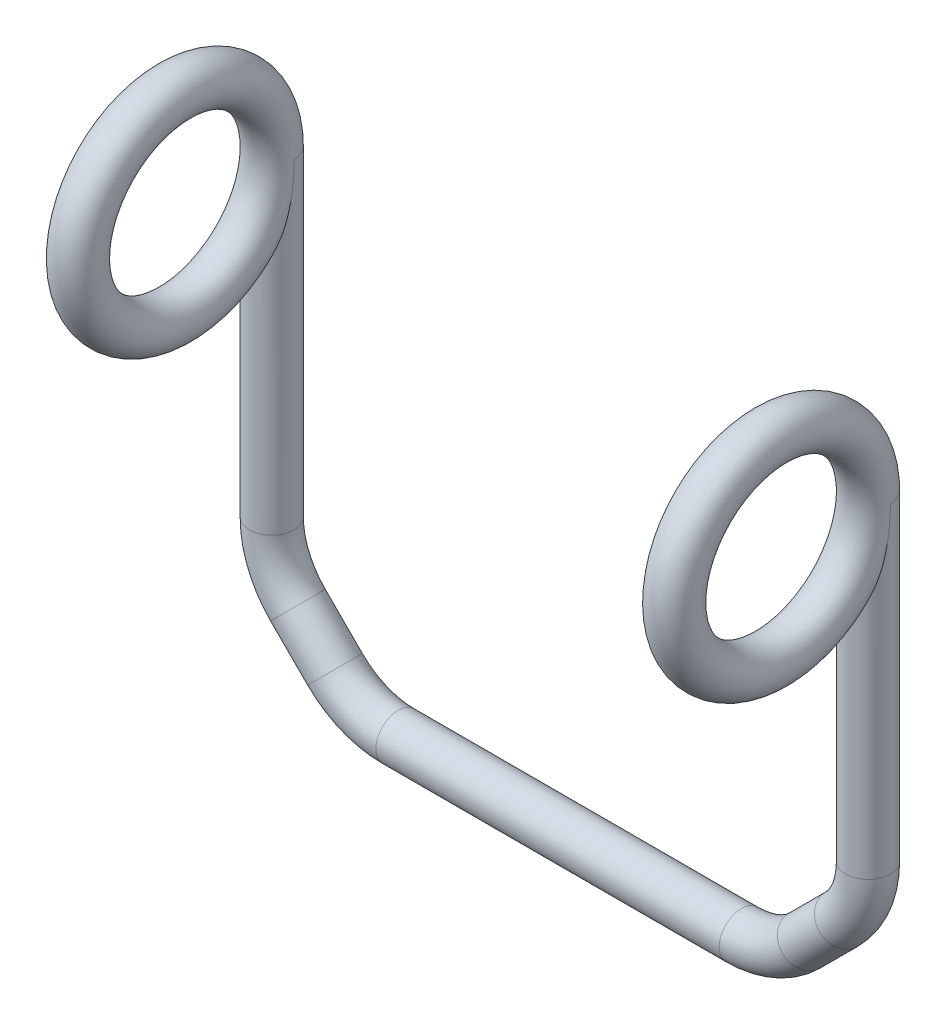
from build123d import *

# Parameters (mm, degrees)
SKETCH4_R = 0.75
SKETCH1_R = 0.7499999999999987


with BuildPart() as part:
    # Bent Wire Retainer- Sweep1: sweep along a path in Sketch3
    with BuildLine(Plane.XY) as bent_wire_retainer_sweep1_path:
        Line((0, 0), (5.757359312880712, 0))
        ThreePointArc((5.757359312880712, 0), (6.905409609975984, 0.2283614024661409), (7.878679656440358, 0.8786796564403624))
        Line((7.878679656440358, 0.8786796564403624), (9.121320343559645, 2.121320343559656))
        ThreePointArc((9.121320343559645, 2.121320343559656), (9.77163859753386, 3.094590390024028), (10, 4.2426406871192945))
        Line((10, 4.2426406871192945), (10, 15))
    # Sketch4 → Bent Wire Retainer- Sweep1 (sweep)
    with BuildSketch(Plane(origin=(0, 0, 0), x_dir=(0, 0, -1), z_dir=(1, 0, 0))):
        Circle(SKETCH4_R)
    sweep(path=bent_wire_retainer_sweep1_path.line)

    # Sketch1 → Spring_ Coil- Revolve1 (revolve)
    with BuildSketch(Plane.XY.offset(3.25)):
        with Locations((9.999999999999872, 18.250000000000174)):
            Circle(SKETCH1_R)
    revolve(axis=Axis((9.999999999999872, 15.00000000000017, 3.25), (1, 0, 0)))

    # Mirror1: part across plane


with BuildPart() as part_1:
    add(part.part)
    add(part.part.mirror(Plane(origin=(0, 0, 0), x_dir=(0, 0, 1), z_dir=(1, 0, 0))))


solid = part_1.part
